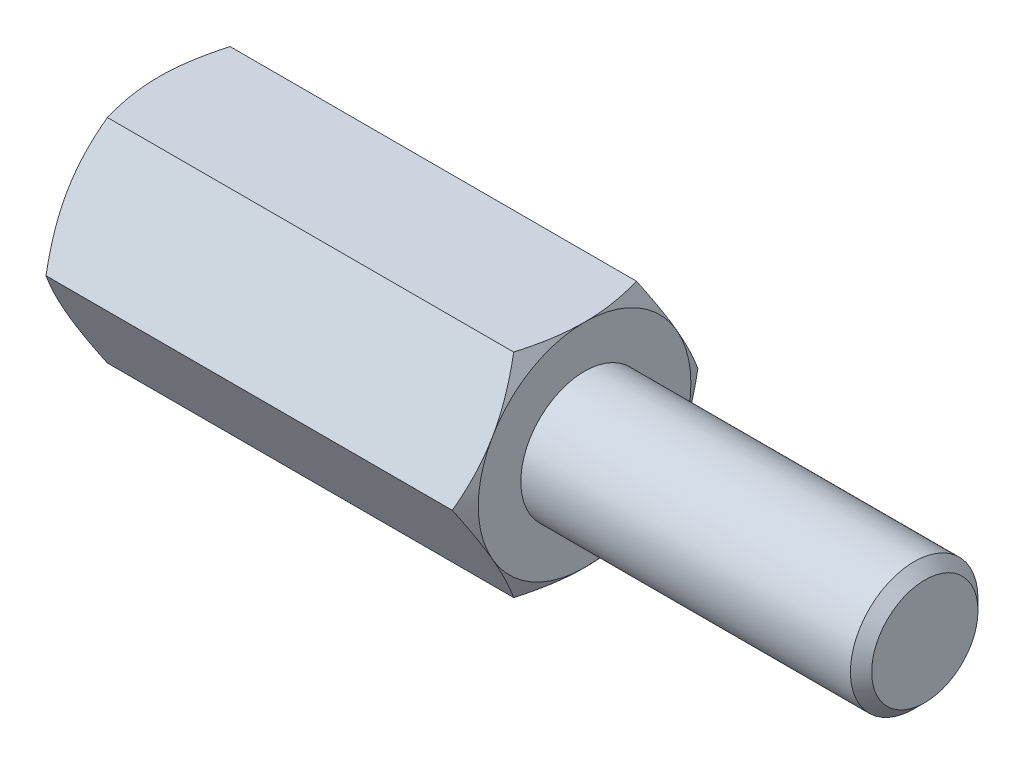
ISO-10303-21;
HEADER;
FILE_DESCRIPTION(('STEP AP214'),'2;1');
FILE_NAME('part.step','',(''),(''),'','','');
FILE_SCHEMA(('AUTOMOTIVE_DESIGN { 1 0 10303 214 1 1 1 1 }'));
ENDSEC;
DATA;
#1=APPLICATION_CONTEXT('core data for automotive mechanical design processes');
#2=APPLICATION_PROTOCOL_DEFINITION('international standard','automotive_design',2000,#1);
#3=PRODUCT_CONTEXT('',#1,'mechanical');
#4=PRODUCT('Part','Part','',(#3));
#5=PRODUCT_RELATED_PRODUCT_CATEGORY('part','',(#4));
#6=PRODUCT_DEFINITION_FORMATION('','',#4);
#7=PRODUCT_DEFINITION_CONTEXT('part definition',#1,'design');
#8=PRODUCT_DEFINITION('design','',#6,#7);
#9=PRODUCT_DEFINITION_SHAPE('','',#8);
#10=(LENGTH_UNIT() NAMED_UNIT(*) SI_UNIT(.MILLI.,.METRE.));
#11=(NAMED_UNIT(*) PLANE_ANGLE_UNIT() SI_UNIT($,.RADIAN.));
#12=(NAMED_UNIT(*) SI_UNIT($,.STERADIAN.) SOLID_ANGLE_UNIT());
#13=UNCERTAINTY_MEASURE_WITH_UNIT(LENGTH_MEASURE(1.E-05),#10,'distance_accuracy_value','');
#14=(GEOMETRIC_REPRESENTATION_CONTEXT(3) GLOBAL_UNCERTAINTY_ASSIGNED_CONTEXT((#13)) GLOBAL_UNIT_ASSIGNED_CONTEXT((#10,
#11,#12)) REPRESENTATION_CONTEXT('',''));
#15=CARTESIAN_POINT('',(0.,0.,0.));
#16=DIRECTION('',(0.,0.,1.));
#17=DIRECTION('',(1.,0.,0.));
#18=AXIS2_PLACEMENT_3D('',#15,#16,#17);
#19=CARTESIAN_POINT('',(5.,2.5,-1.44337567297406));
#20=DIRECTION('',(1.,0.,0.));
#21=DIRECTION('',(0.,0.,-1.));
#22=AXIS2_PLACEMENT_3D('',#19,#20,#21);
#23=PLANE('',#22);
#24=CARTESIAN_POINT('',(5.,0.,0.));
#25=DIRECTION('',(1.,0.,0.));
#26=DIRECTION('',(0.,0.,-1.));
#27=AXIS2_PLACEMENT_3D('',#24,#25,#26);
#28=CIRCLE('',#27,2.5);
#29=CARTESIAN_POINT('',(5.,-1.25,-2.1650635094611));
#30=VERTEX_POINT('',#29);
#31=CARTESIAN_POINT('',(5.,1.25,-2.1650635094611));
#32=VERTEX_POINT('',#31);
#33=EDGE_CURVE('E288',#30,#32,#28,.T.);
#34=ORIENTED_EDGE('',*,*,#33,.T.);
#35=CARTESIAN_POINT('',(5.,2.5,0.));
#36=VERTEX_POINT('',#35);
#37=EDGE_CURVE('E53',#32,#36,#28,.T.);
#38=ORIENTED_EDGE('',*,*,#37,.T.);
#39=CARTESIAN_POINT('',(5.,1.25,2.1650635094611));
#40=VERTEX_POINT('',#39);
#41=EDGE_CURVE('E295',#36,#40,#28,.T.);
#42=ORIENTED_EDGE('',*,*,#41,.T.);
#43=CARTESIAN_POINT('',(5.,-1.25,2.1650635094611));
#44=VERTEX_POINT('',#43);
#45=EDGE_CURVE('E301',#40,#44,#28,.T.);
#46=ORIENTED_EDGE('',*,*,#45,.T.);
#47=CARTESIAN_POINT('',(5.,0.,0.));
#48=DIRECTION('',(-1.,0.,0.));
#49=DIRECTION('',(0.,-1.,0.));
#50=AXIS2_PLACEMENT_3D('',#47,#48,#49);
#51=CIRCLE('',#50,2.5);
#52=CARTESIAN_POINT('',(5.,-2.5,0.));
#53=VERTEX_POINT('',#52);
#54=EDGE_CURVE('E193',#53,#44,#51,.T.);
#55=ORIENTED_EDGE('',*,*,#54,.F.);
#56=EDGE_CURVE('E61',#53,#30,#28,.T.);
#57=ORIENTED_EDGE('',*,*,#56,.T.);
#58=EDGE_LOOP('',(#34,#38,#42,#46,#55,#57));
#59=FACE_BOUND('',#58,.T.);
#60=CARTESIAN_POINT('',(5.,0.,0.));
#61=DIRECTION('',(1.,0.,0.));
#62=DIRECTION('',(0.,0.,-1.));
#63=AXIS2_PLACEMENT_3D('',#60,#61,#62);
#64=CIRCLE('',#63,1.5);
#65=CARTESIAN_POINT('',(5.,0.,-1.5));
#66=VERTEX_POINT('',#65);
#67=EDGE_CURVE('E334',#66,#66,#64,.T.);
#68=ORIENTED_EDGE('',*,*,#67,.F.);
#69=EDGE_LOOP('',(#68));
#70=FACE_BOUND('',#69,.T.);
#71=ADVANCED_FACE('F37',(#59,#70),#23,.T.);
#72=CARTESIAN_POINT('',(5.,0.,-2.88675134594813));
#73=DIRECTION('',(0.,-0.5,0.866025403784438));
#74=DIRECTION('',(0.,-0.866025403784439,-0.5));
#75=AXIS2_PLACEMENT_3D('',#72,#73,#74);
#76=PLANE('',#75);
#77=CARTESIAN_POINT('',(4.77664233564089,-0.000199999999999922,-2.88686681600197));
#78=CARTESIAN_POINT('',(4.81327837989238,0.109663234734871,-2.82343724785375));
#79=CARTESIAN_POINT('',(4.84659778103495,0.220474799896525,-2.75946016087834));
#80=CARTESIAN_POINT('',(4.90475771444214,0.444016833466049,-2.63039810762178));
#81=CARTESIAN_POINT('',(4.92957767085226,0.556751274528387,-2.5653108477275));
#82=CARTESIAN_POINT('',(4.96821434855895,0.780822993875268,-2.43594298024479));
#83=CARTESIAN_POINT('',(4.98228820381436,0.892125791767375,-2.37168227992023));
#84=CARTESIAN_POINT('',(4.99909084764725,1.11525522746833,-2.24285844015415));
#85=CARTESIAN_POINT('',(5.00183354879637,1.22708105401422,-2.17829576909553));
#86=CARTESIAN_POINT('',(4.99613423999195,1.43604197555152,-2.05765212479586));
#87=CARTESIAN_POINT('',(4.98909160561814,1.53320831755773,-2.0015531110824));
#88=CARTESIAN_POINT('',(4.96676858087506,1.726907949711,-1.88972057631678));
#89=CARTESIAN_POINT('',(4.95148056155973,1.82344056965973,-1.8339874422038));
#90=CARTESIAN_POINT('',(4.91326090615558,2.01753972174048,-1.7219242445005));
#91=CARTESIAN_POINT('',(4.89016722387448,2.11508168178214,-1.66560836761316));
#92=CARTESIAN_POINT('',(4.83775334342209,2.30871060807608,-1.55381665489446));
#93=CARTESIAN_POINT('',(4.80844546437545,2.40480005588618,-1.49833938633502));
#94=CARTESIAN_POINT('',(4.77664233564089,2.5002,-1.44326020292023));
#95=B_SPLINE_CURVE_WITH_KNOTS('',3,(#77,#78,#79,#80,#81,#82,#83,#84,#85,#86,#87,#88,#89,#90,#91,
#92,#93,#94),.UNSPECIFIED.,.F.,.F.,(4,2,2,2,2,2,2,2,4),(0.,0.396285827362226,0.79352433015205,
1.18093086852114,1.56786160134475,1.90479741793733,2.24204551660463,2.58677531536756,
2.93082800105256),.UNSPECIFIED.);
#96=CARTESIAN_POINT('',(4.7767090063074,0.,-2.88675134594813));
#97=VERTEX_POINT('',#96);
#98=EDGE_CURVE('E324',#97,#32,#95,.T.);
#99=ORIENTED_EDGE('',*,*,#98,.F.);
#100=DIRECTION('',(-1.,0.,0.));
#101=VECTOR('',#100,1.);
#102=CARTESIAN_POINT('',(5.,0.,-2.88675134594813));
#103=LINE('',#102,#101);
#104=CARTESIAN_POINT('',(-4.7767090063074,0.,-2.88675134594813));
#105=VERTEX_POINT('',#104);
#106=EDGE_CURVE('E264',#97,#105,#103,.T.);
#107=ORIENTED_EDGE('',*,*,#106,.T.);
#108=CARTESIAN_POINT('',(-4.77664233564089,2.5002,-1.44326020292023));
#109=CARTESIAN_POINT('',(-4.81327837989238,2.39033676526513,-1.50668977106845));
#110=CARTESIAN_POINT('',(-4.84659778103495,2.27952520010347,-1.57066685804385));
#111=CARTESIAN_POINT('',(-4.90475771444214,2.05598316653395,-1.69972891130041));
#112=CARTESIAN_POINT('',(-4.92957767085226,1.94324872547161,-1.7648161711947));
#113=CARTESIAN_POINT('',(-4.96821434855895,1.71917700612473,-1.8941840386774));
#114=CARTESIAN_POINT('',(-4.98228820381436,1.60787420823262,-1.95844473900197));
#115=CARTESIAN_POINT('',(-4.99909084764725,1.38474477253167,-2.08726857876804));
#116=CARTESIAN_POINT('',(-5.00183354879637,1.27291894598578,-2.15183124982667));
#117=CARTESIAN_POINT('',(-4.99613423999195,1.06395802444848,-2.27247489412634));
#118=CARTESIAN_POINT('',(-4.98909160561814,0.966791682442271,-2.32857390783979));
#119=CARTESIAN_POINT('',(-4.96676858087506,0.773092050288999,-2.44040644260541));
#120=CARTESIAN_POINT('',(-4.95148056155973,0.676559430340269,-2.49613957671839));
#121=CARTESIAN_POINT('',(-4.91326090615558,0.482460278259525,-2.60820277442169));
#122=CARTESIAN_POINT('',(-4.89016722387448,0.384918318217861,-2.66451865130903));
#123=CARTESIAN_POINT('',(-4.83775334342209,0.191289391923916,-2.77631036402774));
#124=CARTESIAN_POINT('',(-4.80844546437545,0.0951999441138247,-2.83178763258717));
#125=CARTESIAN_POINT('',(-4.77664233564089,-0.000199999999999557,-2.88686681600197));
#126=B_SPLINE_CURVE_WITH_KNOTS('',3,(#108,#109,#110,#111,#112,#113,#114,#115,#116,#117,#118,
#119,#120,#121,#122,#123,#124,#125),.UNSPECIFIED.,.F.,.F.,(4,2,2,2,2,2,2,2,4),(0.,
0.396285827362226,0.793524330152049,1.18093086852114,1.56786160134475,1.90479741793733,
2.24204551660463,2.58677531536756,2.93082800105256),.UNSPECIFIED.);
#127=CARTESIAN_POINT('',(-5.,1.25,-2.1650635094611));
#128=VERTEX_POINT('',#127);
#129=EDGE_CURVE('E336',#128,#105,#126,.T.);
#130=ORIENTED_EDGE('',*,*,#129,.F.);
#131=CARTESIAN_POINT('',(-4.7767090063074,2.5,-1.44337567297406));
#132=VERTEX_POINT('',#131);
#133=EDGE_CURVE('E338',#132,#128,#126,.T.);
#134=ORIENTED_EDGE('',*,*,#133,.F.);
#135=DIRECTION('',(-1.,0.,0.));
#136=VECTOR('',#135,1.);
#137=CARTESIAN_POINT('',(5.,2.5,-1.44337567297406));
#138=LINE('',#137,#136);
#139=CARTESIAN_POINT('',(4.77670900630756,2.5,-1.44337567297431));
#140=VERTEX_POINT('',#139);
#141=EDGE_CURVE('E279',#140,#132,#138,.T.);
#142=ORIENTED_EDGE('',*,*,#141,.F.);
#143=EDGE_CURVE('E229',#32,#140,#95,.T.);
#144=ORIENTED_EDGE('',*,*,#143,.F.);
#145=EDGE_LOOP('',(#99,#107,#130,#134,#142,#144));
#146=FACE_BOUND('',#145,.T.);
#147=ADVANCED_FACE('F148',(#146),#76,.F.);
#148=CARTESIAN_POINT('',(5.,2.5,-1.44337567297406));
#149=DIRECTION('',(0.,-1.,0.));
#150=DIRECTION('',(0.,0.,-1.));
#151=AXIS2_PLACEMENT_3D('',#148,#149,#150);
#152=PLANE('',#151);
#153=CARTESIAN_POINT('',(3.76803388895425,2.5,-3.90158441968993));
#154=CARTESIAN_POINT('',(3.82120772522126,2.5,-3.79217004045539));
#155=CARTESIAN_POINT('',(3.87387869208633,2.5,-3.68250707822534));
#156=CARTESIAN_POINT('',(3.97793249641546,2.5,-3.46255185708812));
#157=CARTESIAN_POINT('',(4.02931513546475,2.5,-3.35225950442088));
#158=CARTESIAN_POINT('',(4.13076309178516,2.5,-3.130356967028));
#159=CARTESIAN_POINT('',(4.18081992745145,2.5,-3.01874289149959));
#160=CARTESIAN_POINT('',(4.27891712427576,2.5,-2.79463535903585));
#161=CARTESIAN_POINT('',(4.32695757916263,2.5,-2.68214194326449));
#162=CARTESIAN_POINT('',(4.42201845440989,2.5,-2.45240385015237));
#163=CARTESIAN_POINT('',(4.46895431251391,2.5,-2.33512399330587));
#164=CARTESIAN_POINT('',(4.55933269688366,2.5,-2.09920133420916));
#165=CARTESIAN_POINT('',(4.60277483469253,2.5,-1.98055838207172));
#166=CARTESIAN_POINT('',(4.68504351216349,2.5,-1.74193489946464));
#167=CARTESIAN_POINT('',(4.72387917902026,2.5,-1.6219575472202));
#168=CARTESIAN_POINT('',(4.79570507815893,2.5,-1.38028205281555));
#169=CARTESIAN_POINT('',(4.82869712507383,2.5,-1.25858445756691));
#170=CARTESIAN_POINT('',(4.88709594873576,2.5,-1.01406369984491));
#171=CARTESIAN_POINT('',(4.91254379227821,2.5,-0.891250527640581));
#172=CARTESIAN_POINT('',(4.95442751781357,2.5,-0.644071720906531));
#173=CARTESIAN_POINT('',(4.97086432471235,2.5,-0.519706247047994));
#174=CARTESIAN_POINT('',(4.9932006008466,2.5,-0.271679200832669));
#175=CARTESIAN_POINT('',(4.99923751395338,2.5,-0.148030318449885));
#176=CARTESIAN_POINT('',(5.00062561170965,2.5,0.0993395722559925));
#177=CARTESIAN_POINT('',(4.99597656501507,2.5,0.223060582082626));
#178=CARTESIAN_POINT('',(4.97940443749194,2.5,0.432351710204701));
#179=CARTESIAN_POINT('',(4.97010665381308,2.5,0.518143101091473));
#180=CARTESIAN_POINT('',(4.94693847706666,2.5,0.689112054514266));
#181=CARTESIAN_POINT('',(4.93306748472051,2.5,0.774289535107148));
#182=CARTESIAN_POINT('',(4.88532020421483,2.5,1.02876599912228));
#183=CARTESIAN_POINT('',(4.84531764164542,2.5,1.19691958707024));
#184=CARTESIAN_POINT('',(4.75226567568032,2.5,1.53362893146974));
#185=CARTESIAN_POINT('',(4.69893620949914,2.5,1.70210423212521));
#186=CARTESIAN_POINT('',(4.61237169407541,2.5,1.95247339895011));
#187=CARTESIAN_POINT('',(4.58242477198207,2.5,2.03553184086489));
#188=CARTESIAN_POINT('',(4.52068409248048,2.5,2.20095860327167));
#189=CARTESIAN_POINT('',(4.48889037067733,2.5,2.2833269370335));
#190=CARTESIAN_POINT('',(4.40401426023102,2.5,2.49723312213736));
#191=CARTESIAN_POINT('',(4.34971733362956,2.5,2.6282879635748));
#192=CARTESIAN_POINT('',(4.23812739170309,2.5,2.88912034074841));
#193=CARTESIAN_POINT('',(4.1808341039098,2.5,3.01889775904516));
#194=CARTESIAN_POINT('',(4.06393487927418,2.5,3.27745045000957));
#195=CARTESIAN_POINT('',(4.00432825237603,2.5,3.40622540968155));
#196=CARTESIAN_POINT('',(3.8833234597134,2.5,3.66293235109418));
#197=CARTESIAN_POINT('',(3.82192524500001,2.5,3.79086430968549));
#198=CARTESIAN_POINT('',(3.6354580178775,2.5,4.17399495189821));
#199=CARTESIAN_POINT('',(3.50828249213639,2.5,4.42816724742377));
#200=CARTESIAN_POINT('',(3.25034557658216,2.5,4.93461464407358));
#201=CARTESIAN_POINT('',(3.11958483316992,2.5,5.18689007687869));
#202=CARTESIAN_POINT('',(2.86871001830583,2.5,5.66512451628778));
#203=CARTESIAN_POINT('',(2.74882986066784,2.5,5.89120644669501));
#204=CARTESIAN_POINT('',(2.50759021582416,2.5,6.34259369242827));
#205=CARTESIAN_POINT('',(2.38623065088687,2.5,6.56789896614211));
#206=CARTESIAN_POINT('',(2.14278038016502,2.5,7.01722044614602));
#207=CARTESIAN_POINT('',(2.02069305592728,2.5,7.24123848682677));
#208=CARTESIAN_POINT('',(1.77566624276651,2.5,7.68878772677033));
#209=CARTESIAN_POINT('',(1.65272681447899,2.5,7.9123189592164));
#210=CARTESIAN_POINT('',(1.52947566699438,2.5,8.13567697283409));
#211=B_SPLINE_CURVE_WITH_KNOTS('',3,(#153,#154,#155,#156,#157,#158,#159,#160,#161,#162,#163,
#164,#165,#166,#167,#168,#169,#170,#171,#172,#173,#174,#175,#176,#177,#178,#179,#180,#181,#182,
#183,#184,#185,#186,#187,#188,#189,#190,#191,#192,#193,#194,#195,#196,#197,#198,#199,#200,#201,
#202,#203,#204,#205,#206,#207,#208,#209,#210),.UNSPECIFIED.,.F.,.F.,(4,2,2,2,2,2,2,2,2,2,2,2,2,
2,2,2,2,2,2,2,2,2,2,2,2,2,2,2,4),(0.,0.364957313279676,0.729970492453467,1.09692930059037,
1.46387103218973,1.84279746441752,2.22176597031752,2.59997058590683,2.97805755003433,
3.35404692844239,3.72999770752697,4.10094071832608,4.47189175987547,4.73064905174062,
4.98944026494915,5.5072907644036,6.03710483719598,6.30196454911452,6.56681915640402,
6.99233818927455,7.41789598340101,7.84358170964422,8.26927907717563,9.12186602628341,
9.9743002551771,10.7419897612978,11.5097197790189,12.2750964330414,13.0404191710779),.UNSPECIFIED.);
#212=EDGE_CURVE('E227',#140,#36,#211,.T.);
#213=ORIENTED_EDGE('',*,*,#212,.F.);
#214=ORIENTED_EDGE('',*,*,#141,.T.);
#215=CARTESIAN_POINT('',(-3.76803388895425,2.5,-3.90158441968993));
#216=CARTESIAN_POINT('',(-3.82120772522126,2.5,-3.79217004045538));
#217=CARTESIAN_POINT('',(-3.87387869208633,2.5,-3.68250707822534));
#218=CARTESIAN_POINT('',(-3.97793249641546,2.5,-3.46255185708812));
#219=CARTESIAN_POINT('',(-4.02931513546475,2.5,-3.35225950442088));
#220=CARTESIAN_POINT('',(-4.13076309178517,2.5,-3.130356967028));
#221=CARTESIAN_POINT('',(-4.18081992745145,2.5,-3.01874289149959));
#222=CARTESIAN_POINT('',(-4.27891712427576,2.5,-2.79463535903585));
#223=CARTESIAN_POINT('',(-4.32695757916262,2.5,-2.68214194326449));
#224=CARTESIAN_POINT('',(-4.42201845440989,2.5,-2.45240385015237));
#225=CARTESIAN_POINT('',(-4.46895431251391,2.5,-2.33512399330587));
#226=CARTESIAN_POINT('',(-4.55933269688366,2.5,-2.09920133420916));
#227=CARTESIAN_POINT('',(-4.60277483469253,2.5,-1.98055838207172));
#228=CARTESIAN_POINT('',(-4.68504351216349,2.5,-1.74193489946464));
#229=CARTESIAN_POINT('',(-4.72387917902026,2.5,-1.6219575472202));
#230=CARTESIAN_POINT('',(-4.79570507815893,2.5,-1.38028205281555));
#231=CARTESIAN_POINT('',(-4.82869712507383,2.5,-1.25858445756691));
#232=CARTESIAN_POINT('',(-4.88709594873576,2.5,-1.01406369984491));
#233=CARTESIAN_POINT('',(-4.91254379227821,2.5,-0.891250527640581));
#234=CARTESIAN_POINT('',(-4.95442751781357,2.5,-0.64407172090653));
#235=CARTESIAN_POINT('',(-4.97086432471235,2.5,-0.519706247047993));
#236=CARTESIAN_POINT('',(-4.9932006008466,2.5,-0.271679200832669));
#237=CARTESIAN_POINT('',(-4.99923751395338,2.5,-0.148030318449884));
#238=CARTESIAN_POINT('',(-5.00062561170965,2.5,0.0993395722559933));
#239=CARTESIAN_POINT('',(-4.99597656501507,2.5,0.223060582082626));
#240=CARTESIAN_POINT('',(-4.97940443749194,2.5,0.432351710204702));
#241=CARTESIAN_POINT('',(-4.97010665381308,2.5,0.518143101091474));
#242=CARTESIAN_POINT('',(-4.94693847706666,2.5,0.689112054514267));
#243=CARTESIAN_POINT('',(-4.93306748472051,2.5,0.774289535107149));
#244=CARTESIAN_POINT('',(-4.88532020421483,2.5,1.02876599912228));
#245=CARTESIAN_POINT('',(-4.84531764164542,2.5,1.19691958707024));
#246=CARTESIAN_POINT('',(-4.75226567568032,2.5,1.53362893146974));
#247=CARTESIAN_POINT('',(-4.69893620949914,2.5,1.70210423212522));
#248=CARTESIAN_POINT('',(-4.61237169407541,2.5,1.95247339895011));
#249=CARTESIAN_POINT('',(-4.58242477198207,2.5,2.03553184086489));
#250=CARTESIAN_POINT('',(-4.52068409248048,2.5,2.20095860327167));
#251=CARTESIAN_POINT('',(-4.48889037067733,2.5,2.2833269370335));
#252=CARTESIAN_POINT('',(-4.40401426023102,2.5,2.49723312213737));
#253=CARTESIAN_POINT('',(-4.34971733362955,2.5,2.6282879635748));
#254=CARTESIAN_POINT('',(-4.23812739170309,2.5,2.88912034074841));
#255=CARTESIAN_POINT('',(-4.1808341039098,2.5,3.01889775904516));
#256=CARTESIAN_POINT('',(-4.06393487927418,2.5,3.27745045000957));
#257=CARTESIAN_POINT('',(-4.00432825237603,2.5,3.40622540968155));
#258=CARTESIAN_POINT('',(-3.8833234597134,2.5,3.66293235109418));
#259=CARTESIAN_POINT('',(-3.82192524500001,2.5,3.79086430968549));
#260=CARTESIAN_POINT('',(-3.6354580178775,2.5,4.17399495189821));
#261=CARTESIAN_POINT('',(-3.50828249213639,2.5,4.42816724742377));
#262=CARTESIAN_POINT('',(-3.25034557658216,2.5,4.93461464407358));
#263=CARTESIAN_POINT('',(-3.11958483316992,2.5,5.18689007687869));
#264=CARTESIAN_POINT('',(-2.86871001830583,2.5,5.66512451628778));
#265=CARTESIAN_POINT('',(-2.74882986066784,2.5,5.89120644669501));
#266=CARTESIAN_POINT('',(-2.50759021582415,2.5,6.34259369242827));
#267=CARTESIAN_POINT('',(-2.38623065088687,2.5,6.56789896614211));
#268=CARTESIAN_POINT('',(-2.14278038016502,2.5,7.01722044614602));
#269=CARTESIAN_POINT('',(-2.02069305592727,2.5,7.24123848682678));
#270=CARTESIAN_POINT('',(-1.77566624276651,2.5,7.68878772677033));
#271=CARTESIAN_POINT('',(-1.65272681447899,2.5,7.9123189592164));
#272=CARTESIAN_POINT('',(-1.52947566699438,2.5,8.13567697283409));
#273=B_SPLINE_CURVE_WITH_KNOTS('',3,(#215,#216,#217,#218,#219,#220,#221,#222,#223,#224,#225,
#226,#227,#228,#229,#230,#231,#232,#233,#234,#235,#236,#237,#238,#239,#240,#241,#242,#243,#244,
#245,#246,#247,#248,#249,#250,#251,#252,#253,#254,#255,#256,#257,#258,#259,#260,#261,#262,#263,
#264,#265,#266,#267,#268,#269,#270,#271,#272),.UNSPECIFIED.,.F.,.F.,(4,2,2,2,2,2,2,2,2,2,2,2,2,
2,2,2,2,2,2,2,2,2,2,2,2,2,2,2,4),(0.,0.364957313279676,0.729970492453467,1.09692930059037,
1.46387103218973,1.84279746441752,2.22176597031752,2.59997058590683,2.97805755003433,
3.35404692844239,3.72999770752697,4.10094071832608,4.47189175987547,4.73064905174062,
4.98944026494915,5.5072907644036,6.03710483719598,6.30196454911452,6.56681915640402,
6.99233818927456,7.41789598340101,7.84358170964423,8.26927907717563,9.12186602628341,
9.97430025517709,10.7419897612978,11.5097197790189,12.2750964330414,13.0404191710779),.UNSPECIFIED.);
#274=CARTESIAN_POINT('',(-5.,2.5,0.));
#275=VERTEX_POINT('',#274);
#276=EDGE_CURVE('E241',#275,#132,#273,.F.);
#277=ORIENTED_EDGE('',*,*,#276,.F.);
#278=CARTESIAN_POINT('',(-4.7767090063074,2.5,1.44337567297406));
#279=VERTEX_POINT('',#278);
#280=EDGE_CURVE('E249',#279,#275,#273,.F.);
#281=ORIENTED_EDGE('',*,*,#280,.F.);
#282=DIRECTION('',(-1.,0.,0.));
#283=VECTOR('',#282,1.);
#284=CARTESIAN_POINT('',(5.,2.5,1.44337567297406));
#285=LINE('',#284,#283);
#286=CARTESIAN_POINT('',(4.7767090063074,2.5,1.44337567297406));
#287=VERTEX_POINT('',#286);
#288=EDGE_CURVE('E276',#287,#279,#285,.T.);
#289=ORIENTED_EDGE('',*,*,#288,.F.);
#290=EDGE_CURVE('E221',#36,#287,#211,.T.);
#291=ORIENTED_EDGE('',*,*,#290,.F.);
#292=EDGE_LOOP('',(#213,#214,#277,#281,#289,#291));
#293=FACE_BOUND('',#292,.T.);
#294=ADVANCED_FACE('F153',(#293),#152,.F.);
#295=CARTESIAN_POINT('',(5.,2.5,1.44337567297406));
#296=DIRECTION('',(0.,-0.5,-0.866025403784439));
#297=DIRECTION('',(0.,0.866025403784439,-0.5));
#298=AXIS2_PLACEMENT_3D('',#295,#296,#297);
#299=PLANE('',#298);
#300=CARTESIAN_POINT('',(4.77664233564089,2.5002,1.44326020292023));
#301=CARTESIAN_POINT('',(4.81327837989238,2.39033676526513,1.50668977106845));
#302=CARTESIAN_POINT('',(4.84659778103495,2.27952520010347,1.57066685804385));
#303=CARTESIAN_POINT('',(4.90475771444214,2.05598316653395,1.69972891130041));
#304=CARTESIAN_POINT('',(4.92957767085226,1.94324872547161,1.7648161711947));
#305=CARTESIAN_POINT('',(4.96821434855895,1.71917700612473,1.8941840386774));
#306=CARTESIAN_POINT('',(4.98228820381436,1.60787420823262,1.95844473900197));
#307=CARTESIAN_POINT('',(4.99909084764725,1.38474477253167,2.08726857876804));
#308=CARTESIAN_POINT('',(5.00183354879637,1.27291894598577,2.15183124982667));
#309=CARTESIAN_POINT('',(4.99613423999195,1.06395802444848,2.27247489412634));
#310=CARTESIAN_POINT('',(4.98909160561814,0.96679168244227,2.32857390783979));
#311=CARTESIAN_POINT('',(4.96676858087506,0.773092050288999,2.44040644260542));
#312=CARTESIAN_POINT('',(4.95148056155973,0.676559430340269,2.49613957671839));
#313=CARTESIAN_POINT('',(4.91326090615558,0.482460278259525,2.60820277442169));
#314=CARTESIAN_POINT('',(4.89016722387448,0.384918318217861,2.66451865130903));
#315=CARTESIAN_POINT('',(4.83775334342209,0.191289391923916,2.77631036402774));
#316=CARTESIAN_POINT('',(4.80844546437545,0.0951999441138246,2.83178763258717));
#317=CARTESIAN_POINT('',(4.77664233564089,-0.000199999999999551,2.88686681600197));
#318=B_SPLINE_CURVE_WITH_KNOTS('',3,(#300,#301,#302,#303,#304,#305,#306,#307,#308,#309,#310,
#311,#312,#313,#314,#315,#316,#317),.UNSPECIFIED.,.F.,.F.,(4,2,2,2,2,2,2,2,4),(0.,
0.396285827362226,0.79352433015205,1.18093086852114,1.56786160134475,1.90479741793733,
2.24204551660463,2.58677531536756,2.93082800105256),.UNSPECIFIED.);
#319=EDGE_CURVE('E228',#287,#40,#318,.T.);
#320=ORIENTED_EDGE('',*,*,#319,.F.);
#321=ORIENTED_EDGE('',*,*,#288,.T.);
#322=CARTESIAN_POINT('',(-4.77664233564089,-0.000199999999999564,2.88686681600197));
#323=CARTESIAN_POINT('',(-4.81327837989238,0.109663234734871,2.82343724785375));
#324=CARTESIAN_POINT('',(-4.84659778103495,0.220474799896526,2.75946016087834));
#325=CARTESIAN_POINT('',(-4.90475771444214,0.44401683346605,2.63039810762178));
#326=CARTESIAN_POINT('',(-4.92957767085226,0.556751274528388,2.5653108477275));
#327=CARTESIAN_POINT('',(-4.96821434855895,0.780822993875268,2.43594298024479));
#328=CARTESIAN_POINT('',(-4.98228820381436,0.892125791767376,2.37168227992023));
#329=CARTESIAN_POINT('',(-4.99909084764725,1.11525522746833,2.24285844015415));
#330=CARTESIAN_POINT('',(-5.00183354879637,1.22708105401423,2.17829576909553));
#331=CARTESIAN_POINT('',(-4.99613423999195,1.43604197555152,2.05765212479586));
#332=CARTESIAN_POINT('',(-4.98909160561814,1.53320831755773,2.0015531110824));
#333=CARTESIAN_POINT('',(-4.96676858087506,1.726907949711,1.88972057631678));
#334=CARTESIAN_POINT('',(-4.95148056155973,1.82344056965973,1.8339874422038));
#335=CARTESIAN_POINT('',(-4.91326090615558,2.01753972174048,1.7219242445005));
#336=CARTESIAN_POINT('',(-4.89016722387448,2.11508168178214,1.66560836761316));
#337=CARTESIAN_POINT('',(-4.83775334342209,2.30871060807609,1.55381665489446));
#338=CARTESIAN_POINT('',(-4.80844546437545,2.40480005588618,1.49833938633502));
#339=CARTESIAN_POINT('',(-4.77664233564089,2.5002,1.44326020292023));
#340=B_SPLINE_CURVE_WITH_KNOTS('',3,(#322,#323,#324,#325,#326,#327,#328,#329,#330,#331,#332,
#333,#334,#335,#336,#337,#338,#339),.UNSPECIFIED.,.F.,.F.,(4,2,2,2,2,2,2,2,4),(0.,
0.396285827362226,0.79352433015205,1.18093086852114,1.56786160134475,1.90479741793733,
2.24204551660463,2.58677531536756,2.93082800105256),.UNSPECIFIED.);
#341=CARTESIAN_POINT('',(-5.,1.25,2.1650635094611));
#342=VERTEX_POINT('',#341);
#343=EDGE_CURVE('E255',#342,#279,#340,.T.);
#344=ORIENTED_EDGE('',*,*,#343,.F.);
#345=CARTESIAN_POINT('',(-4.7767090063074,0.,2.88675134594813));
#346=VERTEX_POINT('',#345);
#347=EDGE_CURVE('E262',#346,#342,#340,.T.);
#348=ORIENTED_EDGE('',*,*,#347,.F.);
#349=DIRECTION('',(-1.,0.,0.));
#350=VECTOR('',#349,1.);
#351=CARTESIAN_POINT('',(5.,0.,2.88675134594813));
#352=LINE('',#351,#350);
#353=CARTESIAN_POINT('',(4.7767090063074,0.,2.88675134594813));
#354=VERTEX_POINT('',#353);
#355=EDGE_CURVE('E273',#354,#346,#352,.T.);
#356=ORIENTED_EDGE('',*,*,#355,.F.);
#357=EDGE_CURVE('E215',#40,#354,#318,.T.);
#358=ORIENTED_EDGE('',*,*,#357,.F.);
#359=EDGE_LOOP('',(#320,#321,#344,#348,#356,#358));
#360=FACE_BOUND('',#359,.T.);
#361=ADVANCED_FACE('F235',(#360),#299,.F.);
#362=CARTESIAN_POINT('',(5.,0.,2.88675134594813));
#363=DIRECTION('',(0.,0.5,-0.866025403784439));
#364=DIRECTION('',(0.,0.866025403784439,0.5));
#365=AXIS2_PLACEMENT_3D('',#362,#363,#364);
#366=PLANE('',#365);
#367=CARTESIAN_POINT('',(4.77664233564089,0.000200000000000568,2.88686681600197));
#368=CARTESIAN_POINT('',(4.81327837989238,-0.10966323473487,2.82343724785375));
#369=CARTESIAN_POINT('',(4.84659778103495,-0.220474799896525,2.75946016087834));
#370=CARTESIAN_POINT('',(4.90475771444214,-0.444016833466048,2.63039810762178));
#371=CARTESIAN_POINT('',(4.92957767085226,-0.556751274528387,2.5653108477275));
#372=CARTESIAN_POINT('',(4.96821434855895,-0.780822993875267,2.43594298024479));
#373=CARTESIAN_POINT('',(4.98228820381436,-0.892125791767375,2.37168227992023));
#374=CARTESIAN_POINT('',(4.99909084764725,-1.11525522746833,2.24285844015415));
#375=CARTESIAN_POINT('',(5.00183354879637,-1.22708105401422,2.17829576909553));
#376=CARTESIAN_POINT('',(4.99613423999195,-1.43604197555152,2.05765212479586));
#377=CARTESIAN_POINT('',(4.98909160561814,-1.53320831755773,2.0015531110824));
#378=CARTESIAN_POINT('',(4.96676858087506,-1.726907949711,1.88972057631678));
#379=CARTESIAN_POINT('',(4.95148056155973,-1.82344056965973,1.8339874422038));
#380=CARTESIAN_POINT('',(4.91326090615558,-2.01753972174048,1.7219242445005));
#381=CARTESIAN_POINT('',(4.89016722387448,-2.11508168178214,1.66560836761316));
#382=CARTESIAN_POINT('',(4.83775334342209,-2.30871060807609,1.55381665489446));
#383=CARTESIAN_POINT('',(4.80844546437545,-2.40480005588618,1.49833938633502));
#384=CARTESIAN_POINT('',(4.77664233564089,-2.5002,1.44326020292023));
#385=B_SPLINE_CURVE_WITH_KNOTS('',3,(#367,#368,#369,#370,#371,#372,#373,#374,#375,#376,#377,
#378,#379,#380,#381,#382,#383,#384),.UNSPECIFIED.,.F.,.F.,(4,2,2,2,2,2,2,2,4),(0.,
0.396285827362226,0.793524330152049,1.18093086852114,1.56786160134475,1.90479741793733,
2.24204551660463,2.58677531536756,2.93082800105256),.UNSPECIFIED.);
#386=EDGE_CURVE('E400',#354,#44,#385,.T.);
#387=ORIENTED_EDGE('',*,*,#386,.F.);
#388=ORIENTED_EDGE('',*,*,#355,.T.);
#389=CARTESIAN_POINT('',(-4.77664233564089,-2.5002,1.44326020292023));
#390=CARTESIAN_POINT('',(-4.81327837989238,-2.39033676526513,1.50668977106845));
#391=CARTESIAN_POINT('',(-4.84659778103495,-2.27952520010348,1.57066685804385));
#392=CARTESIAN_POINT('',(-4.90475771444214,-2.05598316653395,1.69972891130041));
#393=CARTESIAN_POINT('',(-4.92957767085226,-1.94324872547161,1.7648161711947));
#394=CARTESIAN_POINT('',(-4.96821434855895,-1.71917700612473,1.8941840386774));
#395=CARTESIAN_POINT('',(-4.98228820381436,-1.60787420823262,1.95844473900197));
#396=CARTESIAN_POINT('',(-4.99909084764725,-1.38474477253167,2.08726857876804));
#397=CARTESIAN_POINT('',(-5.00183354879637,-1.27291894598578,2.15183124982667));
#398=CARTESIAN_POINT('',(-4.99613423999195,-1.06395802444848,2.27247489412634));
#399=CARTESIAN_POINT('',(-4.98909160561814,-0.96679168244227,2.32857390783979));
#400=CARTESIAN_POINT('',(-4.96676858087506,-0.773092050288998,2.44040644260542));
#401=CARTESIAN_POINT('',(-4.95148056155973,-0.676559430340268,2.49613957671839));
#402=CARTESIAN_POINT('',(-4.91326090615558,-0.482460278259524,2.60820277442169));
#403=CARTESIAN_POINT('',(-4.89016722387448,-0.384918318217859,2.66451865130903));
#404=CARTESIAN_POINT('',(-4.83775334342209,-0.191289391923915,2.77631036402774));
#405=CARTESIAN_POINT('',(-4.80844546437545,-0.0951999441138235,2.83178763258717));
#406=CARTESIAN_POINT('',(-4.77664233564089,0.000200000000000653,2.88686681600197));
#407=B_SPLINE_CURVE_WITH_KNOTS('',3,(#389,#390,#391,#392,#393,#394,#395,#396,#397,#398,#399,
#400,#401,#402,#403,#404,#405,#406),.UNSPECIFIED.,.F.,.F.,(4,2,2,2,2,2,2,2,4),(0.,
0.396285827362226,0.793524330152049,1.18093086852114,1.56786160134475,1.90479741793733,
2.24204551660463,2.58677531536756,2.93082800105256),.UNSPECIFIED.);
#408=CARTESIAN_POINT('',(-5.,-1.25,2.1650635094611));
#409=VERTEX_POINT('',#408);
#410=EDGE_CURVE('E263',#409,#346,#407,.T.);
#411=ORIENTED_EDGE('',*,*,#410,.F.);
#412=CARTESIAN_POINT('',(-4.7767090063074,-2.5,1.44337567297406));
#413=VERTEX_POINT('',#412);
#414=EDGE_CURVE('E250',#413,#409,#407,.T.);
#415=ORIENTED_EDGE('',*,*,#414,.F.);
#416=DIRECTION('',(-1.,0.,0.));
#417=VECTOR('',#416,1.);
#418=CARTESIAN_POINT('',(5.,-2.5,1.44337567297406));
#419=LINE('',#418,#417);
#420=CARTESIAN_POINT('',(4.7767090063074,-2.5,1.44337567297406));
#421=VERTEX_POINT('',#420);
#422=EDGE_CURVE('E270',#421,#413,#419,.T.);
#423=ORIENTED_EDGE('',*,*,#422,.F.);
#424=EDGE_CURVE('E210',#44,#421,#385,.T.);
#425=ORIENTED_EDGE('',*,*,#424,.F.);
#426=EDGE_LOOP('',(#387,#388,#411,#415,#423,#425));
#427=FACE_BOUND('',#426,.T.);
#428=ADVANCED_FACE('F398',(#427),#366,.F.);
#429=CARTESIAN_POINT('',(5.,-2.5,1.44337567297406));
#430=DIRECTION('',(0.,1.,0.));
#431=DIRECTION('',(0.,0.,1.));
#432=AXIS2_PLACEMENT_3D('',#429,#430,#431);
#433=PLANE('',#432);
#434=CARTESIAN_POINT('',(3.76803388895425,-2.5,-3.90158441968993));
#435=CARTESIAN_POINT('',(3.82120772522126,-2.5,-3.79217004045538));
#436=CARTESIAN_POINT('',(3.87387869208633,-2.5,-3.68250707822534));
#437=CARTESIAN_POINT('',(3.97793249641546,-2.5,-3.46255185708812));
#438=CARTESIAN_POINT('',(4.02931513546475,-2.5,-3.35225950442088));
#439=CARTESIAN_POINT('',(4.13076309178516,-2.5,-3.130356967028));
#440=CARTESIAN_POINT('',(4.18081992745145,-2.5,-3.01874289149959));
#441=CARTESIAN_POINT('',(4.27891712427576,-2.5,-2.79463535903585));
#442=CARTESIAN_POINT('',(4.32695757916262,-2.5,-2.68214194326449));
#443=CARTESIAN_POINT('',(4.42201845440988,-2.5,-2.45240385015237));
#444=CARTESIAN_POINT('',(4.46895431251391,-2.5,-2.33512399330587));
#445=CARTESIAN_POINT('',(4.55933269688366,-2.5,-2.09920133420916));
#446=CARTESIAN_POINT('',(4.60277483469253,-2.5,-1.98055838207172));
#447=CARTESIAN_POINT('',(4.68504351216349,-2.5,-1.74193489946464));
#448=CARTESIAN_POINT('',(4.72387917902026,-2.5,-1.6219575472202));
#449=CARTESIAN_POINT('',(4.79570507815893,-2.5,-1.38028205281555));
#450=CARTESIAN_POINT('',(4.82869712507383,-2.5,-1.25858445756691));
#451=CARTESIAN_POINT('',(4.88709594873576,-2.5,-1.01406369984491));
#452=CARTESIAN_POINT('',(4.91254379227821,-2.5,-0.891250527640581));
#453=CARTESIAN_POINT('',(4.95442751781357,-2.5,-0.644071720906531));
#454=CARTESIAN_POINT('',(4.97086432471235,-2.5,-0.519706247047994));
#455=CARTESIAN_POINT('',(4.9932006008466,-2.5,-0.27167920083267));
#456=CARTESIAN_POINT('',(4.99923751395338,-2.5,-0.148030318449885));
#457=CARTESIAN_POINT('',(5.00062561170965,-2.5,0.0993395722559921));
#458=CARTESIAN_POINT('',(4.99597656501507,-2.5,0.223060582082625));
#459=CARTESIAN_POINT('',(4.97940443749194,-2.5,0.4323517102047));
#460=CARTESIAN_POINT('',(4.97010665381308,-2.5,0.518143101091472));
#461=CARTESIAN_POINT('',(4.94693847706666,-2.5,0.689112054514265));
#462=CARTESIAN_POINT('',(4.93306748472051,-2.5,0.774289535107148));
#463=CARTESIAN_POINT('',(4.88532020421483,-2.5,1.02876599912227));
#464=CARTESIAN_POINT('',(4.84531764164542,-2.5,1.19691958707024));
#465=CARTESIAN_POINT('',(4.75226567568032,-2.5,1.53362893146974));
#466=CARTESIAN_POINT('',(4.69893620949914,-2.5,1.70210423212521));
#467=CARTESIAN_POINT('',(4.61237169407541,-2.5,1.95247339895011));
#468=CARTESIAN_POINT('',(4.58242477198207,-2.5,2.03553184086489));
#469=CARTESIAN_POINT('',(4.52068409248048,-2.5,2.20095860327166));
#470=CARTESIAN_POINT('',(4.48889037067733,-2.5,2.28332693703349));
#471=CARTESIAN_POINT('',(4.40401426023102,-2.5,2.49723312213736));
#472=CARTESIAN_POINT('',(4.34971733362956,-2.5,2.6282879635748));
#473=CARTESIAN_POINT('',(4.2381273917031,-2.5,2.88912034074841));
#474=CARTESIAN_POINT('',(4.1808341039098,-2.5,3.01889775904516));
#475=CARTESIAN_POINT('',(4.06393487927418,-2.5,3.27745045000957));
#476=CARTESIAN_POINT('',(4.00432825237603,-2.5,3.40622540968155));
#477=CARTESIAN_POINT('',(3.8833234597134,-2.5,3.66293235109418));
#478=CARTESIAN_POINT('',(3.82192524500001,-2.5,3.79086430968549));
#479=CARTESIAN_POINT('',(3.6354580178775,-2.5,4.17399495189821));
#480=CARTESIAN_POINT('',(3.50828249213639,-2.5,4.42816724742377));
#481=CARTESIAN_POINT('',(3.25034557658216,-2.5,4.93461464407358));
#482=CARTESIAN_POINT('',(3.11958483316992,-2.5,5.18689007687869));
#483=CARTESIAN_POINT('',(2.86871001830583,-2.5,5.66512451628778));
#484=CARTESIAN_POINT('',(2.74882986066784,-2.5,5.89120644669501));
#485=CARTESIAN_POINT('',(2.50759021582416,-2.5,6.34259369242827));
#486=CARTESIAN_POINT('',(2.38623065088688,-2.5,6.56789896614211));
#487=CARTESIAN_POINT('',(2.14278038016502,-2.5,7.01722044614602));
#488=CARTESIAN_POINT('',(2.02069305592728,-2.5,7.24123848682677));
#489=CARTESIAN_POINT('',(1.77566624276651,-2.5,7.68878772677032));
#490=CARTESIAN_POINT('',(1.65272681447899,-2.5,7.9123189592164));
#491=CARTESIAN_POINT('',(1.52947566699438,-2.5,8.13567697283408));
#492=B_SPLINE_CURVE_WITH_KNOTS('',3,(#434,#435,#436,#437,#438,#439,#440,#441,#442,#443,#444,
#445,#446,#447,#448,#449,#450,#451,#452,#453,#454,#455,#456,#457,#458,#459,#460,#461,#462,#463,
#464,#465,#466,#467,#468,#469,#470,#471,#472,#473,#474,#475,#476,#477,#478,#479,#480,#481,#482,
#483,#484,#485,#486,#487,#488,#489,#490,#491),.UNSPECIFIED.,.F.,.F.,(4,2,2,2,2,2,2,2,2,2,2,2,2,
2,2,2,2,2,2,2,2,2,2,2,2,2,2,2,4),(0.,0.364957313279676,0.729970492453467,1.09692930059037,
1.46387103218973,1.84279746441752,2.22176597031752,2.59997058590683,2.97805755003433,
3.35404692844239,3.72999770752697,4.10094071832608,4.47189175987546,4.73064905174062,
4.98944026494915,5.50729076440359,6.03710483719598,6.30196454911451,6.56681915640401,
6.99233818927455,7.41789598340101,7.84358170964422,8.26927907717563,9.12186602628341,
9.97430025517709,10.7419897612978,11.5097197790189,12.2750964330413,13.0404191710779),.UNSPECIFIED.);
#493=EDGE_CURVE('E314',#421,#53,#492,.F.);
#494=ORIENTED_EDGE('',*,*,#493,.F.);
#495=ORIENTED_EDGE('',*,*,#422,.T.);
#496=CARTESIAN_POINT('',(-3.76803388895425,-2.5,-3.90158441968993));
#497=CARTESIAN_POINT('',(-3.82120772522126,-2.5,-3.79217004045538));
#498=CARTESIAN_POINT('',(-3.87387869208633,-2.5,-3.68250707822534));
#499=CARTESIAN_POINT('',(-3.97793249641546,-2.5,-3.46255185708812));
#500=CARTESIAN_POINT('',(-4.02931513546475,-2.5,-3.35225950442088));
#501=CARTESIAN_POINT('',(-4.13076309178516,-2.5,-3.130356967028));
#502=CARTESIAN_POINT('',(-4.18081992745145,-2.5,-3.01874289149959));
#503=CARTESIAN_POINT('',(-4.27891712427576,-2.5,-2.79463535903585));
#504=CARTESIAN_POINT('',(-4.32695757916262,-2.5,-2.68214194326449));
#505=CARTESIAN_POINT('',(-4.42201845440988,-2.5,-2.45240385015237));
#506=CARTESIAN_POINT('',(-4.46895431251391,-2.5,-2.33512399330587));
#507=CARTESIAN_POINT('',(-4.55933269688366,-2.5,-2.09920133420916));
#508=CARTESIAN_POINT('',(-4.60277483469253,-2.5,-1.98055838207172));
#509=CARTESIAN_POINT('',(-4.68504351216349,-2.5,-1.74193489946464));
#510=CARTESIAN_POINT('',(-4.72387917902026,-2.5,-1.6219575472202));
#511=CARTESIAN_POINT('',(-4.79570507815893,-2.5,-1.38028205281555));
#512=CARTESIAN_POINT('',(-4.82869712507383,-2.5,-1.25858445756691));
#513=CARTESIAN_POINT('',(-4.88709594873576,-2.5,-1.01406369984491));
#514=CARTESIAN_POINT('',(-4.91254379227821,-2.5,-0.891250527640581));
#515=CARTESIAN_POINT('',(-4.95442751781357,-2.5,-0.644071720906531));
#516=CARTESIAN_POINT('',(-4.97086432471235,-2.5,-0.519706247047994));
#517=CARTESIAN_POINT('',(-4.9932006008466,-2.5,-0.27167920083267));
#518=CARTESIAN_POINT('',(-4.99923751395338,-2.5,-0.148030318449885));
#519=CARTESIAN_POINT('',(-5.00062561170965,-2.5,0.0993395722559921));
#520=CARTESIAN_POINT('',(-4.99597656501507,-2.5,0.223060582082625));
#521=CARTESIAN_POINT('',(-4.97940443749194,-2.5,0.432351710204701));
#522=CARTESIAN_POINT('',(-4.97010665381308,-2.5,0.518143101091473));
#523=CARTESIAN_POINT('',(-4.94693847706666,-2.5,0.689112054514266));
#524=CARTESIAN_POINT('',(-4.93306748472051,-2.5,0.774289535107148));
#525=CARTESIAN_POINT('',(-4.88532020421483,-2.5,1.02876599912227));
#526=CARTESIAN_POINT('',(-4.84531764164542,-2.5,1.19691958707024));
#527=CARTESIAN_POINT('',(-4.75226567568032,-2.5,1.53362893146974));
#528=CARTESIAN_POINT('',(-4.69893620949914,-2.5,1.70210423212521));
#529=CARTESIAN_POINT('',(-4.61237169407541,-2.5,1.95247339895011));
#530=CARTESIAN_POINT('',(-4.58242477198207,-2.5,2.03553184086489));
#531=CARTESIAN_POINT('',(-4.52068409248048,-2.5,2.20095860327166));
#532=CARTESIAN_POINT('',(-4.48889037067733,-2.5,2.28332693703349));
#533=CARTESIAN_POINT('',(-4.40401426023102,-2.5,2.49723312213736));
#534=CARTESIAN_POINT('',(-4.34971733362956,-2.5,2.6282879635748));
#535=CARTESIAN_POINT('',(-4.2381273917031,-2.5,2.88912034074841));
#536=CARTESIAN_POINT('',(-4.1808341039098,-2.5,3.01889775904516));
#537=CARTESIAN_POINT('',(-4.06393487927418,-2.5,3.27745045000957));
#538=CARTESIAN_POINT('',(-4.00432825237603,-2.5,3.40622540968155));
#539=CARTESIAN_POINT('',(-3.8833234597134,-2.5,3.66293235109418));
#540=CARTESIAN_POINT('',(-3.82192524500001,-2.5,3.79086430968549));
#541=CARTESIAN_POINT('',(-3.6354580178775,-2.5,4.17399495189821));
#542=CARTESIAN_POINT('',(-3.50828249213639,-2.5,4.42816724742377));
#543=CARTESIAN_POINT('',(-3.25034557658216,-2.5,4.93461464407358));
#544=CARTESIAN_POINT('',(-3.11958483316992,-2.5,5.18689007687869));
#545=CARTESIAN_POINT('',(-2.86871001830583,-2.5,5.66512451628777));
#546=CARTESIAN_POINT('',(-2.74882986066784,-2.5,5.89120644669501));
#547=CARTESIAN_POINT('',(-2.50759021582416,-2.5,6.34259369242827));
#548=CARTESIAN_POINT('',(-2.38623065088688,-2.5,6.56789896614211));
#549=CARTESIAN_POINT('',(-2.14278038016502,-2.5,7.01722044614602));
#550=CARTESIAN_POINT('',(-2.02069305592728,-2.5,7.24123848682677));
#551=CARTESIAN_POINT('',(-1.77566624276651,-2.5,7.68878772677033));
#552=CARTESIAN_POINT('',(-1.65272681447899,-2.5,7.9123189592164));
#553=CARTESIAN_POINT('',(-1.52947566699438,-2.5,8.13567697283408));
#554=B_SPLINE_CURVE_WITH_KNOTS('',3,(#496,#497,#498,#499,#500,#501,#502,#503,#504,#505,#506,
#507,#508,#509,#510,#511,#512,#513,#514,#515,#516,#517,#518,#519,#520,#521,#522,#523,#524,#525,
#526,#527,#528,#529,#530,#531,#532,#533,#534,#535,#536,#537,#538,#539,#540,#541,#542,#543,#544,
#545,#546,#547,#548,#549,#550,#551,#552,#553),.UNSPECIFIED.,.F.,.F.,(4,2,2,2,2,2,2,2,2,2,2,2,2,
2,2,2,2,2,2,2,2,2,2,2,2,2,2,2,4),(0.,0.364957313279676,0.729970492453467,1.09692930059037,
1.46387103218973,1.84279746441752,2.22176597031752,2.59997058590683,2.97805755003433,
3.35404692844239,3.72999770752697,4.10094071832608,4.47189175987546,4.73064905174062,
4.98944026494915,5.50729076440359,6.03710483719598,6.30196454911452,6.56681915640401,
6.99233818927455,7.41789598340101,7.84358170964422,8.26927907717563,9.12186602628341,
9.97430025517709,10.7419897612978,11.5097197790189,12.2750964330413,13.0404191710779),.UNSPECIFIED.);
#555=CARTESIAN_POINT('',(-5.,-2.5,0.));
#556=VERTEX_POINT('',#555);
#557=EDGE_CURVE('E344',#556,#413,#554,.T.);
#558=ORIENTED_EDGE('',*,*,#557,.F.);
#559=CARTESIAN_POINT('',(-4.7767090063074,-2.5,-1.44337567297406));
#560=VERTEX_POINT('',#559);
#561=EDGE_CURVE('E339',#560,#556,#554,.T.);
#562=ORIENTED_EDGE('',*,*,#561,.F.);
#563=DIRECTION('',(-1.,0.,0.));
#564=VECTOR('',#563,1.);
#565=CARTESIAN_POINT('',(5.,-2.5,-1.44337567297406));
#566=LINE('',#565,#564);
#567=CARTESIAN_POINT('',(4.7767090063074,-2.5,-1.44337567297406));
#568=VERTEX_POINT('',#567);
#569=EDGE_CURVE('E267',#568,#560,#566,.T.);
#570=ORIENTED_EDGE('',*,*,#569,.F.);
#571=EDGE_CURVE('E195',#53,#568,#492,.F.);
#572=ORIENTED_EDGE('',*,*,#571,.F.);
#573=EDGE_LOOP('',(#494,#495,#558,#562,#570,#572));
#574=FACE_BOUND('',#573,.T.);
#575=ADVANCED_FACE('F172',(#574),#433,.F.);
#576=CARTESIAN_POINT('',(5.,-2.5,-1.44337567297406));
#577=DIRECTION('',(0.,0.5,0.866025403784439));
#578=DIRECTION('',(0.,-0.866025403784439,0.5));
#579=AXIS2_PLACEMENT_3D('',#576,#577,#578);
#580=PLANE('',#579);
#581=CARTESIAN_POINT('',(4.77664233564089,-2.5002,-1.44326020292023));
#582=CARTESIAN_POINT('',(4.81327837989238,-2.39033676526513,-1.50668977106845));
#583=CARTESIAN_POINT('',(4.84659778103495,-2.27952520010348,-1.57066685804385));
#584=CARTESIAN_POINT('',(4.90475771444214,-2.05598316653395,-1.69972891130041));
#585=CARTESIAN_POINT('',(4.92957767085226,-1.94324872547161,-1.7648161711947));
#586=CARTESIAN_POINT('',(4.96821434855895,-1.71917700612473,-1.8941840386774));
#587=CARTESIAN_POINT('',(4.98228820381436,-1.60787420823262,-1.95844473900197));
#588=CARTESIAN_POINT('',(4.99909084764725,-1.38474477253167,-2.08726857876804));
#589=CARTESIAN_POINT('',(5.00183354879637,-1.27291894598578,-2.15183124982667));
#590=CARTESIAN_POINT('',(4.99613423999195,-1.06395802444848,-2.27247489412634));
#591=CARTESIAN_POINT('',(4.98909160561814,-0.966791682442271,-2.32857390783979));
#592=CARTESIAN_POINT('',(4.96676858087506,-0.773092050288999,-2.44040644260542));
#593=CARTESIAN_POINT('',(4.95148056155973,-0.676559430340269,-2.49613957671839));
#594=CARTESIAN_POINT('',(4.91326090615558,-0.482460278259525,-2.60820277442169));
#595=CARTESIAN_POINT('',(4.89016722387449,-0.38491831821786,-2.66451865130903));
#596=CARTESIAN_POINT('',(4.83775334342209,-0.191289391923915,-2.77631036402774));
#597=CARTESIAN_POINT('',(4.80844546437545,-0.0951999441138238,-2.83178763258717));
#598=CARTESIAN_POINT('',(4.77664233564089,0.00019999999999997,-2.88686681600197));
#599=B_SPLINE_CURVE_WITH_KNOTS('',3,(#581,#582,#583,#584,#585,#586,#587,#588,#589,#590,#591,
#592,#593,#594,#595,#596,#597,#598),.UNSPECIFIED.,.F.,.F.,(4,2,2,2,2,2,2,2,4),(0.,
0.396285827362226,0.793524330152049,1.18093086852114,1.56786160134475,1.90479741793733,
2.24204551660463,2.58677531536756,2.93082800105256),.UNSPECIFIED.);
#600=EDGE_CURVE('E192',#568,#30,#599,.T.);
#601=ORIENTED_EDGE('',*,*,#600,.F.);
#602=ORIENTED_EDGE('',*,*,#569,.T.);
#603=CARTESIAN_POINT('',(-4.77664233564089,0.000200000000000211,-2.88686681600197));
#604=CARTESIAN_POINT('',(-4.81327837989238,-0.109663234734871,-2.82343724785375));
#605=CARTESIAN_POINT('',(-4.84659778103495,-0.220474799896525,-2.75946016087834));
#606=CARTESIAN_POINT('',(-4.90475771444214,-0.444016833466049,-2.63039810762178));
#607=CARTESIAN_POINT('',(-4.92957767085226,-0.556751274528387,-2.5653108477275));
#608=CARTESIAN_POINT('',(-4.96821434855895,-0.780822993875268,-2.43594298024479));
#609=CARTESIAN_POINT('',(-4.98228820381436,-0.892125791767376,-2.37168227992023));
#610=CARTESIAN_POINT('',(-4.99909084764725,-1.11525522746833,-2.24285844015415));
#611=CARTESIAN_POINT('',(-5.00183354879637,-1.22708105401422,-2.17829576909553));
#612=CARTESIAN_POINT('',(-4.99613423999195,-1.43604197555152,-2.05765212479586));
#613=CARTESIAN_POINT('',(-4.98909160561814,-1.53320831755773,-2.0015531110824));
#614=CARTESIAN_POINT('',(-4.96676858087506,-1.726907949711,-1.88972057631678));
#615=CARTESIAN_POINT('',(-4.95148056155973,-1.82344056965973,-1.8339874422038));
#616=CARTESIAN_POINT('',(-4.91326090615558,-2.01753972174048,-1.7219242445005));
#617=CARTESIAN_POINT('',(-4.89016722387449,-2.11508168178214,-1.66560836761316));
#618=CARTESIAN_POINT('',(-4.83775334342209,-2.30871060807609,-1.55381665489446));
#619=CARTESIAN_POINT('',(-4.80844546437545,-2.40480005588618,-1.49833938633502));
#620=CARTESIAN_POINT('',(-4.77664233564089,-2.5002,-1.44326020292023));
#621=B_SPLINE_CURVE_WITH_KNOTS('',3,(#603,#604,#605,#606,#607,#608,#609,#610,#611,#612,#613,
#614,#615,#616,#617,#618,#619,#620),.UNSPECIFIED.,.F.,.F.,(4,2,2,2,2,2,2,2,4),(0.,
0.396285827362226,0.79352433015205,1.18093086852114,1.56786160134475,1.90479741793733,
2.24204551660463,2.58677531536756,2.93082800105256),.UNSPECIFIED.);
#622=CARTESIAN_POINT('',(-5.,-1.25,-2.1650635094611));
#623=VERTEX_POINT('',#622);
#624=EDGE_CURVE('E178',#623,#560,#621,.T.);
#625=ORIENTED_EDGE('',*,*,#624,.F.);
#626=EDGE_CURVE('E346',#105,#623,#621,.T.);
#627=ORIENTED_EDGE('',*,*,#626,.F.);
#628=ORIENTED_EDGE('',*,*,#106,.F.);
#629=EDGE_CURVE('E185',#30,#97,#599,.T.);
#630=ORIENTED_EDGE('',*,*,#629,.F.);
#631=EDGE_LOOP('',(#601,#602,#625,#627,#628,#630));
#632=FACE_BOUND('',#631,.T.);
#633=ADVANCED_FACE('F167',(#632),#580,.F.);
#634=CARTESIAN_POINT('',(-5.,0.,0.));
#635=DIRECTION('',(1.,0.,0.));
#636=DIRECTION('',(0.,1.,0.));
#637=AXIS2_PLACEMENT_3D('',#634,#635,#636);
#638=CONICAL_SURFACE('',#637,2.5,1.0471975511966);
#639=ORIENTED_EDGE('',*,*,#129,.T.);
#640=ORIENTED_EDGE('',*,*,#626,.T.);
#641=CARTESIAN_POINT('',(-5.,0.,0.));
#642=DIRECTION('',(1.,0.,0.));
#643=DIRECTION('',(0.,0.,-1.));
#644=AXIS2_PLACEMENT_3D('',#641,#642,#643);
#645=CIRCLE('',#644,2.5);
#646=EDGE_CURVE('E282',#623,#128,#645,.T.);
#647=ORIENTED_EDGE('',*,*,#646,.T.);
#648=EDGE_LOOP('',(#639,#640,#647));
#649=FACE_BOUND('',#648,.T.);
#650=ADVANCED_FACE('F171',(#649),#638,.T.);
#651=ORIENTED_EDGE('',*,*,#561,.T.);
#652=EDGE_CURVE('E286',#556,#623,#645,.T.);
#653=ORIENTED_EDGE('',*,*,#652,.T.);
#654=ORIENTED_EDGE('',*,*,#624,.T.);
#655=EDGE_LOOP('',(#651,#653,#654));
#656=FACE_BOUND('',#655,.T.);
#657=ADVANCED_FACE('F390',(#656),#638,.T.);
#658=ORIENTED_EDGE('',*,*,#414,.T.);
#659=CARTESIAN_POINT('',(-5.,0.,0.));
#660=DIRECTION('',(-1.,0.,0.));
#661=DIRECTION('',(0.,-1.,0.));
#662=AXIS2_PLACEMENT_3D('',#659,#660,#661);
#663=CIRCLE('',#662,2.5);
#664=EDGE_CURVE('E321',#556,#409,#663,.T.);
#665=ORIENTED_EDGE('',*,*,#664,.F.);
#666=ORIENTED_EDGE('',*,*,#557,.T.);
#667=EDGE_LOOP('',(#658,#665,#666));
#668=FACE_BOUND('',#667,.T.);
#669=ADVANCED_FACE('F557',(#668),#638,.T.);
#670=ORIENTED_EDGE('',*,*,#347,.T.);
#671=EDGE_CURVE('E317',#342,#409,#645,.T.);
#672=ORIENTED_EDGE('',*,*,#671,.T.);
#673=ORIENTED_EDGE('',*,*,#410,.T.);
#674=EDGE_LOOP('',(#670,#672,#673));
#675=FACE_BOUND('',#674,.T.);
#676=ADVANCED_FACE('F158',(#675),#638,.T.);
#677=ORIENTED_EDGE('',*,*,#343,.T.);
#678=ORIENTED_EDGE('',*,*,#280,.T.);
#679=EDGE_CURVE('E320',#275,#342,#645,.T.);
#680=ORIENTED_EDGE('',*,*,#679,.T.);
#681=EDGE_LOOP('',(#677,#678,#680));
#682=FACE_BOUND('',#681,.T.);
#683=ADVANCED_FACE('F371',(#682),#638,.T.);
#684=ORIENTED_EDGE('',*,*,#276,.T.);
#685=ORIENTED_EDGE('',*,*,#133,.T.);
#686=EDGE_CURVE('E287',#128,#275,#645,.T.);
#687=ORIENTED_EDGE('',*,*,#686,.T.);
#688=EDGE_LOOP('',(#684,#685,#687));
#689=FACE_BOUND('',#688,.T.);
#690=ADVANCED_FACE('F165',(#689),#638,.T.);
#691=CARTESIAN_POINT('',(-5.,2.5,-1.44337567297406));
#692=DIRECTION('',(1.,0.,0.));
#693=DIRECTION('',(0.,0.,-1.));
#694=AXIS2_PLACEMENT_3D('',#691,#692,#693);
#695=PLANE('',#694);
#696=CARTESIAN_POINT('',(-5.,0.,0.));
#697=DIRECTION('',(-1.,0.,0.));
#698=DIRECTION('',(0.,0.,1.));
#699=AXIS2_PLACEMENT_3D('',#696,#697,#698);
#700=CIRCLE('',#699,1.25);
#701=CARTESIAN_POINT('',(-5.,0.,1.25));
#702=VERTEX_POINT('',#701);
#703=EDGE_CURVE('E327',#702,#702,#700,.T.);
#704=ORIENTED_EDGE('',*,*,#703,.F.);
#705=EDGE_LOOP('',(#704));
#706=FACE_BOUND('',#705,.T.);
#707=ORIENTED_EDGE('',*,*,#686,.F.);
#708=ORIENTED_EDGE('',*,*,#646,.F.);
#709=ORIENTED_EDGE('',*,*,#652,.F.);
#710=ORIENTED_EDGE('',*,*,#664,.T.);
#711=ORIENTED_EDGE('',*,*,#671,.F.);
#712=ORIENTED_EDGE('',*,*,#679,.F.);
#713=EDGE_LOOP('',(#707,#708,#709,#710,#711,#712));
#714=FACE_BOUND('',#713,.T.);
#715=ADVANCED_FACE('F161',(#706,#714),#695,.F.);
#716=CARTESIAN_POINT('',(5.,0.,0.));
#717=DIRECTION('',(-1.,0.,0.));
#718=DIRECTION('',(0.,1.,0.));
#719=AXIS2_PLACEMENT_3D('',#716,#717,#718);
#720=CONICAL_SURFACE('',#719,2.5,1.0471975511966);
#721=ORIENTED_EDGE('',*,*,#98,.T.);
#722=ORIENTED_EDGE('',*,*,#33,.F.);
#723=ORIENTED_EDGE('',*,*,#629,.T.);
#724=EDGE_LOOP('',(#721,#722,#723));
#725=FACE_BOUND('',#724,.T.);
#726=ADVANCED_FACE('F164',(#725),#720,.T.);
#727=ORIENTED_EDGE('',*,*,#571,.T.);
#728=ORIENTED_EDGE('',*,*,#600,.T.);
#729=ORIENTED_EDGE('',*,*,#56,.F.);
#730=EDGE_LOOP('',(#727,#728,#729));
#731=FACE_BOUND('',#730,.T.);
#732=ADVANCED_FACE('F202',(#731),#720,.T.);
#733=ORIENTED_EDGE('',*,*,#424,.T.);
#734=ORIENTED_EDGE('',*,*,#493,.T.);
#735=ORIENTED_EDGE('',*,*,#54,.T.);
#736=EDGE_LOOP('',(#733,#734,#735));
#737=FACE_BOUND('',#736,.T.);
#738=ADVANCED_FACE('F416',(#737),#720,.T.);
#739=ORIENTED_EDGE('',*,*,#357,.T.);
#740=ORIENTED_EDGE('',*,*,#386,.T.);
#741=ORIENTED_EDGE('',*,*,#45,.F.);
#742=EDGE_LOOP('',(#739,#740,#741));
#743=FACE_BOUND('',#742,.T.);
#744=ADVANCED_FACE('F414',(#743),#720,.T.);
#745=ORIENTED_EDGE('',*,*,#290,.T.);
#746=ORIENTED_EDGE('',*,*,#319,.T.);
#747=ORIENTED_EDGE('',*,*,#41,.F.);
#748=EDGE_LOOP('',(#745,#746,#747));
#749=FACE_BOUND('',#748,.T.);
#750=ADVANCED_FACE('F413',(#749),#720,.T.);
#751=ORIENTED_EDGE('',*,*,#143,.T.);
#752=ORIENTED_EDGE('',*,*,#212,.T.);
#753=ORIENTED_EDGE('',*,*,#37,.F.);
#754=EDGE_LOOP('',(#751,#752,#753));
#755=FACE_BOUND('',#754,.T.);
#756=ADVANCED_FACE('F143',(#755),#720,.T.);
#757=CARTESIAN_POINT('',(0.,0.,0.));
#758=DIRECTION('',(-1.,0.,0.));
#759=DIRECTION('',(0.,0.,1.));
#760=AXIS2_PLACEMENT_3D('',#757,#758,#759);
#761=CYLINDRICAL_SURFACE('',#760,1.25);
#762=CARTESIAN_POINT('',(0.,0.,0.));
#763=DIRECTION('',(1.,0.,0.));
#764=DIRECTION('',(0.,0.,-1.));
#765=AXIS2_PLACEMENT_3D('',#762,#763,#764);
#766=CIRCLE('',#765,1.25);
#767=CARTESIAN_POINT('',(0.,0.,-1.25));
#768=VERTEX_POINT('',#767);
#769=EDGE_CURVE('E329',#768,#768,#766,.T.);
#770=ORIENTED_EDGE('',*,*,#769,.T.);
#771=EDGE_LOOP('',(#770));
#772=FACE_BOUND('',#771,.T.);
#773=ORIENTED_EDGE('',*,*,#703,.T.);
#774=EDGE_LOOP('',(#773));
#775=FACE_BOUND('',#774,.T.);
#776=ADVANCED_FACE('F133',(#772,#775),#761,.F.);
#777=CARTESIAN_POINT('',(0.721687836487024,0.,0.));
#778=DIRECTION('',(-1.,0.,0.));
#779=DIRECTION('',(0.,0.,1.));
#780=AXIS2_PLACEMENT_3D('',#777,#778,#779);
#781=CONICAL_SURFACE('',#780,0.,1.0471975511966);
#782=ORIENTED_EDGE('',*,*,#769,.F.);
#783=EDGE_LOOP('',(#782));
#784=FACE_BOUND('',#783,.T.);
#785=CARTESIAN_POINT('',(0.721687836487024,0.,0.));
#786=VERTEX_POINT('',#785);
#787=VERTEX_LOOP('',#786);
#788=FACE_BOUND('',#787,.T.);
#789=ADVANCED_FACE('F130',(#784,#788),#781,.F.);
#790=CARTESIAN_POINT('',(13.,0.,0.));
#791=DIRECTION('',(-1.,0.,0.));
#792=DIRECTION('',(0.,0.,1.));
#793=AXIS2_PLACEMENT_3D('',#790,#791,#792);
#794=CYLINDRICAL_SURFACE('',#793,1.5);
#795=CARTESIAN_POINT('',(12.75,0.,0.));
#796=DIRECTION('',(1.,0.,0.));
#797=DIRECTION('',(0.,0.,-1.));
#798=AXIS2_PLACEMENT_3D('',#795,#796,#797);
#799=CIRCLE('',#798,1.5);
#800=CARTESIAN_POINT('',(12.75,0.,-1.5));
#801=VERTEX_POINT('',#800);
#802=EDGE_CURVE('E11',#801,#801,#799,.F.);
#803=ORIENTED_EDGE('',*,*,#802,.T.);
#804=EDGE_LOOP('',(#803));
#805=FACE_BOUND('',#804,.T.);
#806=ORIENTED_EDGE('',*,*,#67,.T.);
#807=EDGE_LOOP('',(#806));
#808=FACE_BOUND('',#807,.T.);
#809=ADVANCED_FACE('F132',(#805,#808),#794,.T.);
#810=CARTESIAN_POINT('',(13.,0.,0.));
#811=DIRECTION('',(1.,0.,0.));
#812=DIRECTION('',(0.,0.,-1.));
#813=AXIS2_PLACEMENT_3D('',#810,#811,#812);
#814=PLANE('',#813);
#815=CARTESIAN_POINT('',(13.,0.,0.));
#816=DIRECTION('',(1.,0.,0.));
#817=DIRECTION('',(0.,0.,-1.));
#818=AXIS2_PLACEMENT_3D('',#815,#816,#817);
#819=CIRCLE('',#818,1.25);
#820=CARTESIAN_POINT('',(13.,0.,-1.25));
#821=VERTEX_POINT('',#820);
#822=EDGE_CURVE('E46',#821,#821,#819,.T.);
#823=ORIENTED_EDGE('',*,*,#822,.T.);
#824=EDGE_LOOP('',(#823));
#825=FACE_BOUND('',#824,.T.);
#826=ADVANCED_FACE('F140',(#825),#814,.T.);
#827=CARTESIAN_POINT('',(13.,0.,0.));
#828=DIRECTION('',(-1.,0.,0.));
#829=DIRECTION('',(0.,0.,1.));
#830=AXIS2_PLACEMENT_3D('',#827,#828,#829);
#831=CONICAL_SURFACE('',#830,1.25,0.785398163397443);
#832=ORIENTED_EDGE('',*,*,#802,.F.);
#833=EDGE_LOOP('',(#832));
#834=FACE_BOUND('',#833,.T.);
#835=ORIENTED_EDGE('',*,*,#822,.F.);
#836=EDGE_LOOP('',(#835));
#837=FACE_BOUND('',#836,.T.);
#838=ADVANCED_FACE('F39',(#834,#837),#831,.T.);
#839=CLOSED_SHELL('',(#71,#147,#294,#361,#428,#575,#633,#650,#657,#669,#676,#683,#690,#715,#726,
#732,#738,#744,#750,#756,#776,#789,#809,#826,#838));
#840=MANIFOLD_SOLID_BREP('B2',#839);
#841=ADVANCED_BREP_SHAPE_REPRESENTATION('',(#18,#840),#14);
#842=SHAPE_DEFINITION_REPRESENTATION(#9,#841);
ENDSEC;
END-ISO-10303-21;
